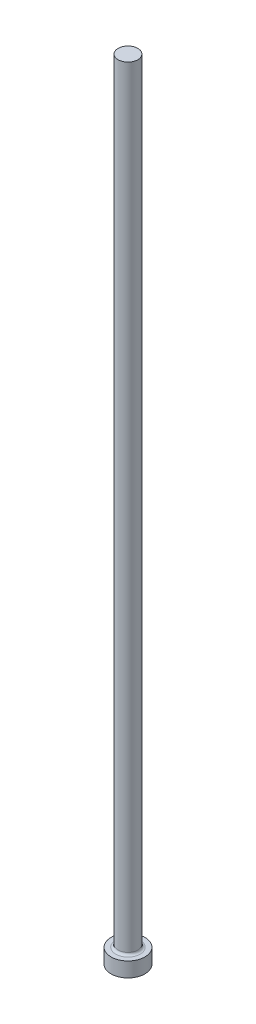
ISO-10303-21;
HEADER;
FILE_DESCRIPTION(('STEP AP214'),'2;1');
FILE_NAME('part.step','',(''),(''),'','','');
FILE_SCHEMA(('AUTOMOTIVE_DESIGN { 1 0 10303 214 1 1 1 1 }'));
ENDSEC;
DATA;
#1=APPLICATION_CONTEXT('core data for automotive mechanical design processes');
#2=APPLICATION_PROTOCOL_DEFINITION('international standard','automotive_design',2000,#1);
#3=PRODUCT_CONTEXT('',#1,'mechanical');
#4=PRODUCT('Part','Part','',(#3));
#5=PRODUCT_RELATED_PRODUCT_CATEGORY('part','',(#4));
#6=PRODUCT_DEFINITION_FORMATION('','',#4);
#7=PRODUCT_DEFINITION_CONTEXT('part definition',#1,'design');
#8=PRODUCT_DEFINITION('design','',#6,#7);
#9=PRODUCT_DEFINITION_SHAPE('','',#8);
#10=(LENGTH_UNIT() NAMED_UNIT(*) SI_UNIT(.MILLI.,.METRE.));
#11=(NAMED_UNIT(*) PLANE_ANGLE_UNIT() SI_UNIT($,.RADIAN.));
#12=(NAMED_UNIT(*) SI_UNIT($,.STERADIAN.) SOLID_ANGLE_UNIT());
#13=UNCERTAINTY_MEASURE_WITH_UNIT(LENGTH_MEASURE(1.E-05),#10,'distance_accuracy_value','');
#14=(GEOMETRIC_REPRESENTATION_CONTEXT(3) GLOBAL_UNCERTAINTY_ASSIGNED_CONTEXT((#13)) GLOBAL_UNIT_ASSIGNED_CONTEXT((#10,
#11,#12)) REPRESENTATION_CONTEXT('',''));
#15=CARTESIAN_POINT('',(0.,0.,0.));
#16=DIRECTION('',(0.,0.,1.));
#17=DIRECTION('',(1.,0.,0.));
#18=AXIS2_PLACEMENT_3D('',#15,#16,#17);
#19=CARTESIAN_POINT('',(3.17499999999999,254.,0.));
#20=DIRECTION('',(0.,-1.,0.));
#21=DIRECTION('',(1.,0.,0.));
#22=AXIS2_PLACEMENT_3D('',#19,#20,#21);
#23=PLANE('',#22);
#24=CARTESIAN_POINT('',(0.,254.,0.));
#25=DIRECTION('',(0.,1.,0.));
#26=DIRECTION('',(-1.,0.,0.));
#27=AXIS2_PLACEMENT_3D('',#24,#25,#26);
#28=CIRCLE('',#27,3.175);
#29=CARTESIAN_POINT('',(-3.17500000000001,254.,0.));
#30=VERTEX_POINT('',#29);
#31=EDGE_CURVE('E10',#30,#30,#28,.T.);
#32=ORIENTED_EDGE('',*,*,#31,.T.);
#33=EDGE_LOOP('',(#32));
#34=FACE_BOUND('',#33,.T.);
#35=ADVANCED_FACE('F30',(#34),#23,.F.);
#36=CARTESIAN_POINT('',(0.,254.,0.));
#37=DIRECTION('',(0.,1.,0.));
#38=DIRECTION('',(-1.,0.,0.));
#39=AXIS2_PLACEMENT_3D('',#36,#37,#38);
#40=CYLINDRICAL_SURFACE('',#39,3.175);
#41=ORIENTED_EDGE('',*,*,#31,.F.);
#42=EDGE_LOOP('',(#41));
#43=FACE_BOUND('',#42,.T.);
#44=CARTESIAN_POINT('',(0.,5.51180000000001,0.));
#45=DIRECTION('',(0.,1.,0.));
#46=DIRECTION('',(-1.,0.,0.));
#47=AXIS2_PLACEMENT_3D('',#44,#45,#46);
#48=CIRCLE('',#47,3.175);
#49=CARTESIAN_POINT('',(-3.175,5.51180000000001,0.));
#50=VERTEX_POINT('',#49);
#51=EDGE_CURVE('E36',#50,#50,#48,.T.);
#52=ORIENTED_EDGE('',*,*,#51,.T.);
#53=EDGE_LOOP('',(#52));
#54=FACE_BOUND('',#53,.T.);
#55=ADVANCED_FACE('F65',(#43,#54),#40,.T.);
#56=CARTESIAN_POINT('',(0.,5.5118,0.));
#57=DIRECTION('',(0.,1.,0.));
#58=DIRECTION('',(-1.,0.,0.));
#59=AXIS2_PLACEMENT_3D('',#56,#57,#58);
#60=TOROIDAL_SURFACE('',#59,3.937,0.762);
#61=ORIENTED_EDGE('',*,*,#51,.F.);
#62=EDGE_LOOP('',(#61));
#63=FACE_BOUND('',#62,.T.);
#64=CARTESIAN_POINT('',(0.,4.7498,0.));
#65=DIRECTION('',(0.,1.,0.));
#66=DIRECTION('',(-1.,0.,0.));
#67=AXIS2_PLACEMENT_3D('',#64,#65,#66);
#68=CIRCLE('',#67,3.937);
#69=CARTESIAN_POINT('',(-3.937,4.7498,0.));
#70=VERTEX_POINT('',#69);
#71=EDGE_CURVE('E40',#70,#70,#68,.T.);
#72=ORIENTED_EDGE('',*,*,#71,.T.);
#73=EDGE_LOOP('',(#72));
#74=FACE_BOUND('',#73,.T.);
#75=ADVANCED_FACE('F69',(#63,#74),#60,.F.);
#76=CARTESIAN_POINT('',(5.461,4.7498,0.));
#77=DIRECTION('',(0.,-1.,0.));
#78=DIRECTION('',(1.,0.,0.));
#79=AXIS2_PLACEMENT_3D('',#76,#77,#78);
#80=PLANE('',#79);
#81=ORIENTED_EDGE('',*,*,#71,.F.);
#82=EDGE_LOOP('',(#81));
#83=FACE_BOUND('',#82,.T.);
#84=CARTESIAN_POINT('',(0.,4.7498,0.));
#85=DIRECTION('',(0.,1.,0.));
#86=DIRECTION('',(-1.,0.,0.));
#87=AXIS2_PLACEMENT_3D('',#84,#85,#86);
#88=CIRCLE('',#87,5.461);
#89=CARTESIAN_POINT('',(-5.461,4.7498,0.));
#90=VERTEX_POINT('',#89);
#91=EDGE_CURVE('E44',#90,#90,#88,.T.);
#92=ORIENTED_EDGE('',*,*,#91,.T.);
#93=EDGE_LOOP('',(#92));
#94=FACE_BOUND('',#93,.T.);
#95=ADVANCED_FACE('F61',(#83,#94),#80,.F.);
#96=CARTESIAN_POINT('',(0.,254.,0.));
#97=DIRECTION('',(0.,1.,0.));
#98=DIRECTION('',(-1.,0.,0.));
#99=AXIS2_PLACEMENT_3D('',#96,#97,#98);
#100=CYLINDRICAL_SURFACE('',#99,5.461);
#101=ORIENTED_EDGE('',*,*,#91,.F.);
#102=EDGE_LOOP('',(#101));
#103=FACE_BOUND('',#102,.T.);
#104=CARTESIAN_POINT('',(0.,0.,0.));
#105=DIRECTION('',(0.,1.,0.));
#106=DIRECTION('',(-1.,0.,0.));
#107=AXIS2_PLACEMENT_3D('',#104,#105,#106);
#108=CIRCLE('',#107,5.461);
#109=CARTESIAN_POINT('',(-5.461,0.,0.));
#110=VERTEX_POINT('',#109);
#111=EDGE_CURVE('E49',#110,#110,#108,.T.);
#112=ORIENTED_EDGE('',*,*,#111,.T.);
#113=EDGE_LOOP('',(#112));
#114=FACE_BOUND('',#113,.T.);
#115=ADVANCED_FACE('F53',(#103,#114),#100,.T.);
#116=CARTESIAN_POINT('',(0.,0.,0.));
#117=DIRECTION('',(0.,1.,0.));
#118=DIRECTION('',(-1.,0.,0.));
#119=AXIS2_PLACEMENT_3D('',#116,#117,#118);
#120=PLANE('',#119);
#121=ORIENTED_EDGE('',*,*,#111,.F.);
#122=EDGE_LOOP('',(#121));
#123=FACE_BOUND('',#122,.T.);
#124=ADVANCED_FACE('F55',(#123),#120,.F.);
#125=CLOSED_SHELL('',(#35,#55,#75,#95,#115,#124));
#126=MANIFOLD_SOLID_BREP('B2',#125);
#127=ADVANCED_BREP_SHAPE_REPRESENTATION('',(#18,#126),#14);
#128=SHAPE_DEFINITION_REPRESENTATION(#9,#127);
ENDSEC;
END-ISO-10303-21;
